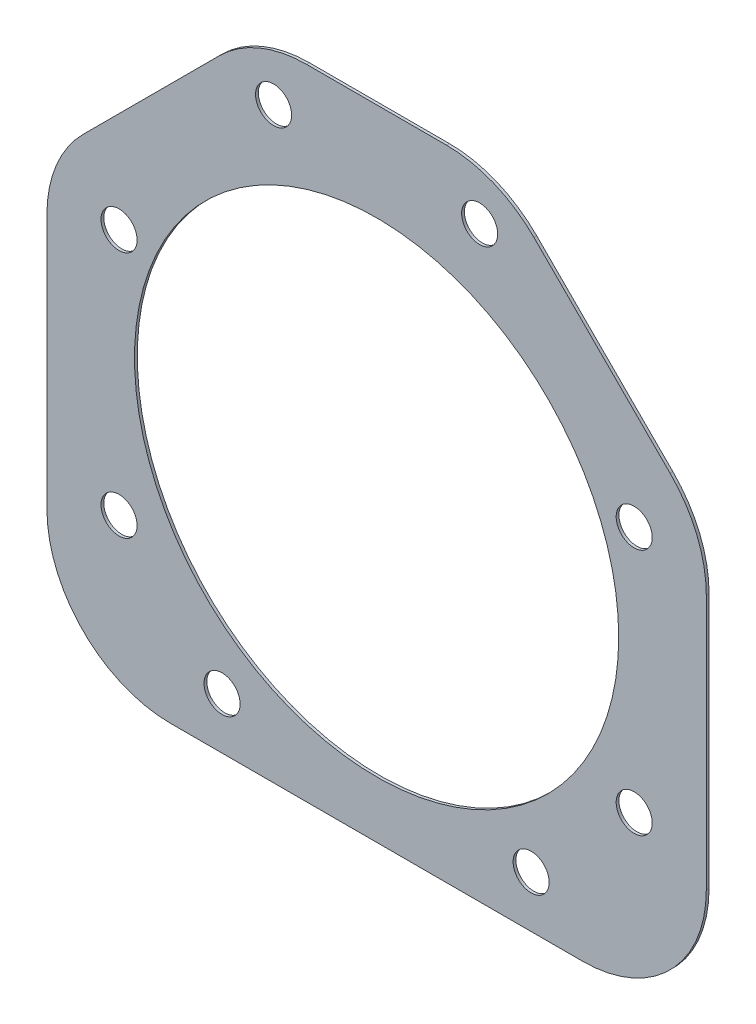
from build123d import *

# Parameters (mm, degrees)
ESQUISSE1_R      = 23.5
ESQUISSE1_R_2    = 1.75
EXTRUSION1_DEPTH = 0.27


with BuildPart() as part:
    # Esquisse1 → Extrusion1 (new body)
    with BuildSketch(Plane.XY):
        with BuildLine():
            Line((-28.485281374, 16.272077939), (-15.272077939, 29.485281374))
            ThreePointArc((-15.272077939, 29.485281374), (-11.378997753, 32.08655439), (-6.786796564, 33))
            Line((-6.786796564, 33), (6.786796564, 33))
            ThreePointArc((6.786796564, 33), (11.378997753, 32.08655439), (15.272077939, 29.485281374))
            Line((15.272077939, 29.485281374), (28.485281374, 16.272077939))
            ThreePointArc((28.485281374, 16.272077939), (31.08655439, 12.378997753), (32, 7.786796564))
            Line((32, 7.786796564), (32, -17))
            ThreePointArc((32, -17), (28.485281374, -25.485281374), (20, -29))
            Line((20, -29), (-20, -29))
            ThreePointArc((-20, -29), (-28.485281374, -25.485281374), (-32, -17))
            Line((-32, -17), (-32, 7.786796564))
            ThreePointArc((-32, 7.786796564), (-31.08655439, 12.378997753), (-28.485281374, 16.272077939))
        make_face()
        Circle(ESQUISSE1_R, mode=Mode.SUBTRACT)
        with Locations((10, 28)):
            Circle(ESQUISSE1_R_2, mode=Mode.SUBTRACT)
        with Locations(Location((-10, 28, 0), (0, 0, 180))):
            Circle(ESQUISSE1_R_2, mode=Mode.SUBTRACT)
        with Locations((25, 10)):
            Circle(ESQUISSE1_R_2, mode=Mode.SUBTRACT)
        with Locations(Location((-25, 10, 0), (0, 0, 180))):
            Circle(ESQUISSE1_R_2, mode=Mode.SUBTRACT)
        with Locations((25, -14)):
            Circle(ESQUISSE1_R_2, mode=Mode.SUBTRACT)
        with Locations(Location((-25, -14, 0), (0, 0, 180))):
            Circle(ESQUISSE1_R_2, mode=Mode.SUBTRACT)
        with Locations((15, -24)):
            Circle(ESQUISSE1_R_2, mode=Mode.SUBTRACT)
        with Locations(Location((-15, -24, 0), (0, 0, 180))):
            Circle(ESQUISSE1_R_2, mode=Mode.SUBTRACT)
    extrude(amount=EXTRUSION1_DEPTH)


solid = part.part
